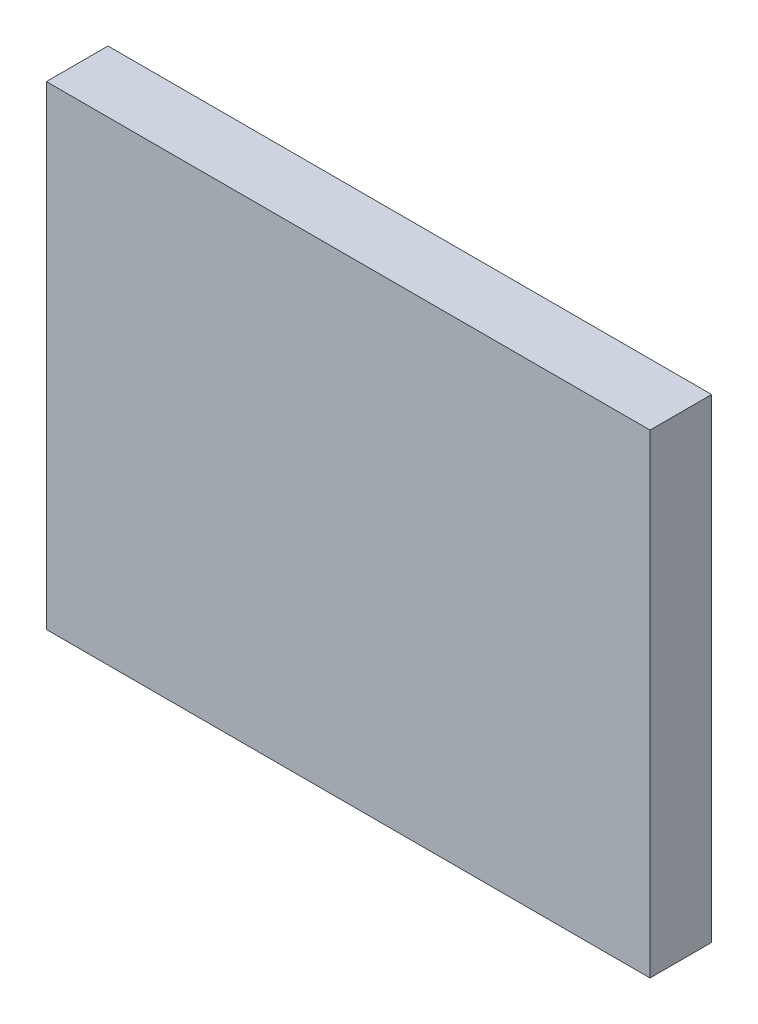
from build123d import *

# Parameters (mm, degrees)
CROQUIS1_W              = 97.975672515
CROQUIS1_H              = 77.016959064
SALIENTE_EXTRUIR1_DEPTH = 10


with BuildPart() as part:
    # Croquis1 → Saliente-Extruir1 (new body)
    with BuildSketch(Plane.XY):
        with Locations((3.595183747, -6.060350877)):
            Rectangle(CROQUIS1_W, CROQUIS1_H)
    extrude(amount=SALIENTE_EXTRUIR1_DEPTH)


solid = part.part
